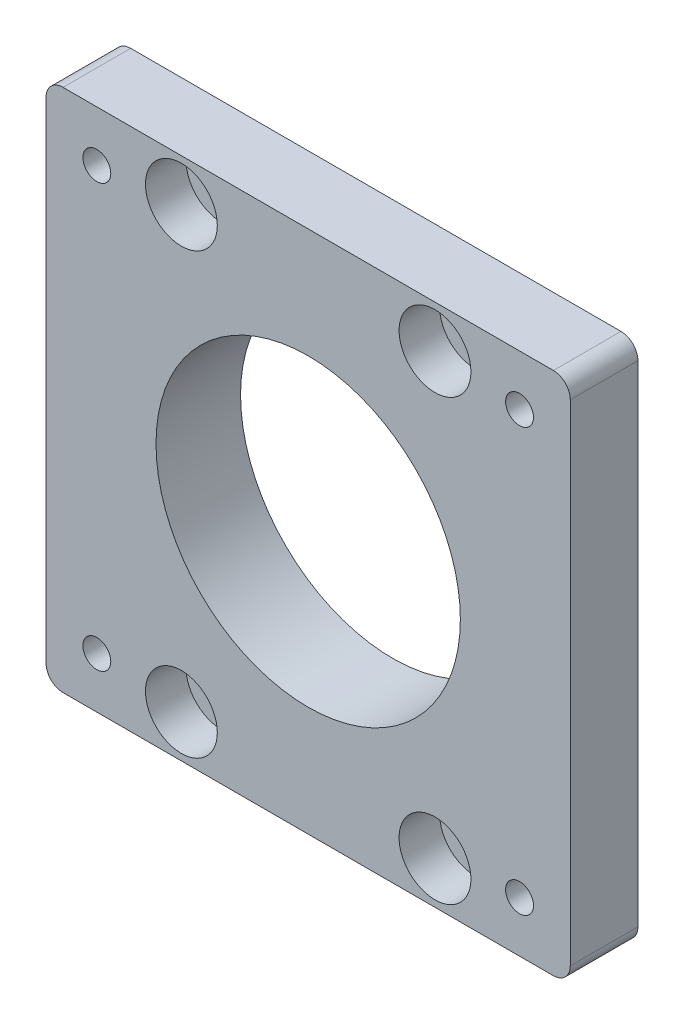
ISO-10303-21;
HEADER;
FILE_DESCRIPTION(('STEP AP214'),'2;1');
FILE_NAME('part.step','',(''),(''),'','','');
FILE_SCHEMA(('AUTOMOTIVE_DESIGN { 1 0 10303 214 1 1 1 1 }'));
ENDSEC;
DATA;
#1=APPLICATION_CONTEXT('core data for automotive mechanical design processes');
#2=APPLICATION_PROTOCOL_DEFINITION('international standard','automotive_design',2000,#1);
#3=PRODUCT_CONTEXT('',#1,'mechanical');
#4=PRODUCT('Part','Part','',(#3));
#5=PRODUCT_RELATED_PRODUCT_CATEGORY('part','',(#4));
#6=PRODUCT_DEFINITION_FORMATION('','',#4);
#7=PRODUCT_DEFINITION_CONTEXT('part definition',#1,'design');
#8=PRODUCT_DEFINITION('design','',#6,#7);
#9=PRODUCT_DEFINITION_SHAPE('','',#8);
#10=(LENGTH_UNIT() NAMED_UNIT(*) SI_UNIT(.MILLI.,.METRE.));
#11=(NAMED_UNIT(*) PLANE_ANGLE_UNIT() SI_UNIT($,.RADIAN.));
#12=(NAMED_UNIT(*) SI_UNIT($,.STERADIAN.) SOLID_ANGLE_UNIT());
#13=UNCERTAINTY_MEASURE_WITH_UNIT(LENGTH_MEASURE(1.E-05),#10,'distance_accuracy_value','');
#14=(GEOMETRIC_REPRESENTATION_CONTEXT(3) GLOBAL_UNCERTAINTY_ASSIGNED_CONTEXT((#13)) GLOBAL_UNIT_ASSIGNED_CONTEXT((#10,
#11,#12)) REPRESENTATION_CONTEXT('',''));
#15=CARTESIAN_POINT('',(0.,0.,0.));
#16=DIRECTION('',(0.,0.,1.));
#17=DIRECTION('',(1.,0.,0.));
#18=AXIS2_PLACEMENT_3D('',#15,#16,#17);
#19=CARTESIAN_POINT('',(0.,0.,0.));
#20=DIRECTION('',(0.,0.,-1.));
#21=DIRECTION('',(-1.,0.,0.));
#22=AXIS2_PLACEMENT_3D('',#19,#20,#21);
#23=PLANE('',#22);
#24=CARTESIAN_POINT('',(-25.,25.,0.));
#25=DIRECTION('',(0.,0.,-1.));
#26=DIRECTION('',(-1.,0.,0.));
#27=AXIS2_PLACEMENT_3D('',#24,#25,#26);
#28=CIRCLE('',#27,1.64999999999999);
#29=CARTESIAN_POINT('',(-26.65,25.,0.));
#30=VERTEX_POINT('',#29);
#31=EDGE_CURVE('E310',#30,#30,#28,.T.);
#32=ORIENTED_EDGE('',*,*,#31,.F.);
#33=EDGE_LOOP('',(#32));
#34=FACE_BOUND('',#33,.T.);
#35=CARTESIAN_POINT('',(-25.,-25.,0.));
#36=DIRECTION('',(0.,0.,-1.));
#37=DIRECTION('',(-1.,0.,0.));
#38=AXIS2_PLACEMENT_3D('',#35,#36,#37);
#39=CIRCLE('',#38,1.64999999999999);
#40=CARTESIAN_POINT('',(-26.65,-25.,0.));
#41=VERTEX_POINT('',#40);
#42=EDGE_CURVE('E302',#41,#41,#39,.T.);
#43=ORIENTED_EDGE('',*,*,#42,.F.);
#44=EDGE_LOOP('',(#43));
#45=FACE_BOUND('',#44,.T.);
#46=CARTESIAN_POINT('',(25.,-25.,0.));
#47=DIRECTION('',(0.,0.,-1.));
#48=DIRECTION('',(-1.,0.,0.));
#49=AXIS2_PLACEMENT_3D('',#46,#47,#48);
#50=CIRCLE('',#49,1.64999999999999);
#51=CARTESIAN_POINT('',(23.35,-25.,0.));
#52=VERTEX_POINT('',#51);
#53=EDGE_CURVE('E294',#52,#52,#50,.T.);
#54=ORIENTED_EDGE('',*,*,#53,.F.);
#55=EDGE_LOOP('',(#54));
#56=FACE_BOUND('',#55,.T.);
#57=CARTESIAN_POINT('',(25.,25.,0.));
#58=DIRECTION('',(0.,0.,-1.));
#59=DIRECTION('',(-1.,0.,0.));
#60=AXIS2_PLACEMENT_3D('',#57,#58,#59);
#61=CIRCLE('',#60,1.64999999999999);
#62=CARTESIAN_POINT('',(23.35,25.,0.));
#63=VERTEX_POINT('',#62);
#64=EDGE_CURVE('E44',#63,#63,#61,.T.);
#65=ORIENTED_EDGE('',*,*,#64,.F.);
#66=EDGE_LOOP('',(#65));
#67=FACE_BOUND('',#66,.T.);
#68=DIRECTION('',(0.,-1.,0.));
#69=VECTOR('',#68,1.);
#70=CARTESIAN_POINT('',(-31.,-31.,0.));
#71=LINE('',#70,#69);
#72=CARTESIAN_POINT('',(-31.,29.,0.));
#73=VERTEX_POINT('',#72);
#74=CARTESIAN_POINT('',(-31.,-29.,0.));
#75=VERTEX_POINT('',#74);
#76=EDGE_CURVE('E127',#73,#75,#71,.T.);
#77=ORIENTED_EDGE('',*,*,#76,.F.);
#78=CARTESIAN_POINT('',(-29.,29.,0.));
#79=DIRECTION('',(0.,0.,-1.));
#80=DIRECTION('',(-1.,0.,0.));
#81=AXIS2_PLACEMENT_3D('',#78,#79,#80);
#82=CIRCLE('',#81,2.);
#83=CARTESIAN_POINT('',(-29.,31.,0.));
#84=VERTEX_POINT('',#83);
#85=EDGE_CURVE('E109',#73,#84,#82,.T.);
#86=ORIENTED_EDGE('',*,*,#85,.T.);
#87=DIRECTION('',(-1.,0.,0.));
#88=VECTOR('',#87,1.);
#89=CARTESIAN_POINT('',(-31.,31.,0.));
#90=LINE('',#89,#88);
#91=CARTESIAN_POINT('',(29.,31.,0.));
#92=VERTEX_POINT('',#91);
#93=EDGE_CURVE('E138',#92,#84,#90,.T.);
#94=ORIENTED_EDGE('',*,*,#93,.F.);
#95=CARTESIAN_POINT('',(29.,29.,0.));
#96=DIRECTION('',(0.,0.,-1.));
#97=DIRECTION('',(-1.,0.,0.));
#98=AXIS2_PLACEMENT_3D('',#95,#96,#97);
#99=CIRCLE('',#98,2.);
#100=CARTESIAN_POINT('',(31.,29.,0.));
#101=VERTEX_POINT('',#100);
#102=EDGE_CURVE('E131',#92,#101,#99,.T.);
#103=ORIENTED_EDGE('',*,*,#102,.T.);
#104=DIRECTION('',(0.,1.,0.));
#105=VECTOR('',#104,1.);
#106=CARTESIAN_POINT('',(31.,-31.,0.));
#107=LINE('',#106,#105);
#108=CARTESIAN_POINT('',(31.,-29.,0.));
#109=VERTEX_POINT('',#108);
#110=EDGE_CURVE('E146',#109,#101,#107,.T.);
#111=ORIENTED_EDGE('',*,*,#110,.F.);
#112=CARTESIAN_POINT('',(29.,-29.,0.));
#113=DIRECTION('',(0.,0.,-1.));
#114=DIRECTION('',(-1.,0.,0.));
#115=AXIS2_PLACEMENT_3D('',#112,#113,#114);
#116=CIRCLE('',#115,2.);
#117=CARTESIAN_POINT('',(29.,-31.,0.));
#118=VERTEX_POINT('',#117);
#119=EDGE_CURVE('E179',#109,#118,#116,.T.);
#120=ORIENTED_EDGE('',*,*,#119,.T.);
#121=DIRECTION('',(1.,0.,0.));
#122=VECTOR('',#121,1.);
#123=CARTESIAN_POINT('',(-31.,-31.,0.));
#124=LINE('',#123,#122);
#125=CARTESIAN_POINT('',(-29.,-31.,0.));
#126=VERTEX_POINT('',#125);
#127=EDGE_CURVE('E137',#126,#118,#124,.T.);
#128=ORIENTED_EDGE('',*,*,#127,.F.);
#129=CARTESIAN_POINT('',(-29.,-29.,0.));
#130=DIRECTION('',(0.,0.,-1.));
#131=DIRECTION('',(-1.,0.,0.));
#132=AXIS2_PLACEMENT_3D('',#129,#130,#131);
#133=CIRCLE('',#132,2.);
#134=EDGE_CURVE('E121',#126,#75,#133,.T.);
#135=ORIENTED_EDGE('',*,*,#134,.T.);
#136=EDGE_LOOP('',(#77,#86,#94,#103,#111,#120,#128,#135));
#137=FACE_BOUND('',#136,.T.);
#138=CARTESIAN_POINT('',(-15.,25.9807621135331,0.));
#139=DIRECTION('',(0.,0.,1.));
#140=DIRECTION('',(1.,0.,0.));
#141=AXIS2_PLACEMENT_3D('',#138,#139,#140);
#142=CIRCLE('',#141,2.25);
#143=CARTESIAN_POINT('',(-12.75,25.9807621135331,0.));
#144=VERTEX_POINT('',#143);
#145=EDGE_CURVE('E233',#144,#144,#142,.T.);
#146=ORIENTED_EDGE('',*,*,#145,.T.);
#147=EDGE_LOOP('',(#146));
#148=FACE_BOUND('',#147,.T.);
#149=CARTESIAN_POINT('',(15.,25.9807621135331,0.));
#150=DIRECTION('',(0.,0.,1.));
#151=DIRECTION('',(1.,0.,0.));
#152=AXIS2_PLACEMENT_3D('',#149,#150,#151);
#153=CIRCLE('',#152,2.25);
#154=CARTESIAN_POINT('',(17.25,25.9807621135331,0.));
#155=VERTEX_POINT('',#154);
#156=EDGE_CURVE('E243',#155,#155,#153,.T.);
#157=ORIENTED_EDGE('',*,*,#156,.T.);
#158=EDGE_LOOP('',(#157));
#159=FACE_BOUND('',#158,.T.);
#160=CARTESIAN_POINT('',(15.,-25.9807621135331,0.));
#161=DIRECTION('',(0.,0.,1.));
#162=DIRECTION('',(1.,0.,0.));
#163=AXIS2_PLACEMENT_3D('',#160,#161,#162);
#164=CIRCLE('',#163,2.25);
#165=CARTESIAN_POINT('',(17.25,-25.9807621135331,0.));
#166=VERTEX_POINT('',#165);
#167=EDGE_CURVE('E247',#166,#166,#164,.T.);
#168=ORIENTED_EDGE('',*,*,#167,.T.);
#169=EDGE_LOOP('',(#168));
#170=FACE_BOUND('',#169,.T.);
#171=CARTESIAN_POINT('',(-15.,-25.9807621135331,0.));
#172=DIRECTION('',(0.,0.,1.));
#173=DIRECTION('',(1.,0.,0.));
#174=AXIS2_PLACEMENT_3D('',#171,#172,#173);
#175=CIRCLE('',#174,2.25);
#176=CARTESIAN_POINT('',(-12.75,-25.9807621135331,0.));
#177=VERTEX_POINT('',#176);
#178=EDGE_CURVE('E154',#177,#177,#175,.T.);
#179=ORIENTED_EDGE('',*,*,#178,.T.);
#180=EDGE_LOOP('',(#179));
#181=FACE_BOUND('',#180,.T.);
#182=CARTESIAN_POINT('',(0.,0.,0.));
#183=DIRECTION('',(0.,0.,-1.));
#184=DIRECTION('',(-1.,0.,0.));
#185=AXIS2_PLACEMENT_3D('',#182,#183,#184);
#186=CIRCLE('',#185,25.);
#187=CARTESIAN_POINT('',(-25.,0.,0.));
#188=VERTEX_POINT('',#187);
#189=EDGE_CURVE('E280',#188,#188,#186,.T.);
#190=ORIENTED_EDGE('',*,*,#189,.F.);
#191=EDGE_LOOP('',(#190));
#192=FACE_BOUND('',#191,.T.);
#193=ADVANCED_FACE('F40',(#34,#45,#56,#67,#137,#148,#159,#170,#181,#192),#23,.T.);
#194=CARTESIAN_POINT('',(-15.,-25.9807621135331,0.));
#195=DIRECTION('',(0.,0.,1.));
#196=DIRECTION('',(1.,0.,0.));
#197=AXIS2_PLACEMENT_3D('',#194,#195,#196);
#198=CYLINDRICAL_SURFACE('',#197,2.25);
#199=ORIENTED_EDGE('',*,*,#178,.F.);
#200=EDGE_LOOP('',(#199));
#201=FACE_BOUND('',#200,.T.);
#202=CARTESIAN_POINT('',(-15.,-25.9807621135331,3.2));
#203=DIRECTION('',(0.,0.,1.));
#204=DIRECTION('',(1.,0.,0.));
#205=AXIS2_PLACEMENT_3D('',#202,#203,#204);
#206=CIRCLE('',#205,2.25);
#207=CARTESIAN_POINT('',(-12.75,-25.9807621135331,3.2));
#208=VERTEX_POINT('',#207);
#209=EDGE_CURVE('E168',#208,#208,#206,.F.);
#210=ORIENTED_EDGE('',*,*,#209,.F.);
#211=EDGE_LOOP('',(#210));
#212=FACE_BOUND('',#211,.T.);
#213=ADVANCED_FACE('F358',(#201,#212),#198,.F.);
#214=CARTESIAN_POINT('',(15.,-25.9807621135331,0.));
#215=DIRECTION('',(0.,0.,1.));
#216=DIRECTION('',(1.,0.,0.));
#217=AXIS2_PLACEMENT_3D('',#214,#215,#216);
#218=CYLINDRICAL_SURFACE('',#217,2.25);
#219=ORIENTED_EDGE('',*,*,#167,.F.);
#220=EDGE_LOOP('',(#219));
#221=FACE_BOUND('',#220,.T.);
#222=CARTESIAN_POINT('',(15.,-25.9807621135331,3.2));
#223=DIRECTION('',(0.,0.,1.));
#224=DIRECTION('',(1.,0.,0.));
#225=AXIS2_PLACEMENT_3D('',#222,#223,#224);
#226=CIRCLE('',#225,2.25);
#227=CARTESIAN_POINT('',(17.25,-25.9807621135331,3.2));
#228=VERTEX_POINT('',#227);
#229=EDGE_CURVE('E162',#228,#228,#226,.F.);
#230=ORIENTED_EDGE('',*,*,#229,.F.);
#231=EDGE_LOOP('',(#230));
#232=FACE_BOUND('',#231,.T.);
#233=ADVANCED_FACE('F364',(#221,#232),#218,.F.);
#234=CARTESIAN_POINT('',(15.,25.9807621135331,0.));
#235=DIRECTION('',(0.,0.,1.));
#236=DIRECTION('',(1.,0.,0.));
#237=AXIS2_PLACEMENT_3D('',#234,#235,#236);
#238=CYLINDRICAL_SURFACE('',#237,2.25);
#239=ORIENTED_EDGE('',*,*,#156,.F.);
#240=EDGE_LOOP('',(#239));
#241=FACE_BOUND('',#240,.T.);
#242=CARTESIAN_POINT('',(15.,25.9807621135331,3.2));
#243=DIRECTION('',(0.,0.,1.));
#244=DIRECTION('',(1.,0.,0.));
#245=AXIS2_PLACEMENT_3D('',#242,#243,#244);
#246=CIRCLE('',#245,2.25);
#247=CARTESIAN_POINT('',(17.25,25.9807621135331,3.2));
#248=VERTEX_POINT('',#247);
#249=EDGE_CURVE('E156',#248,#248,#246,.F.);
#250=ORIENTED_EDGE('',*,*,#249,.F.);
#251=EDGE_LOOP('',(#250));
#252=FACE_BOUND('',#251,.T.);
#253=ADVANCED_FACE('F432',(#241,#252),#238,.F.);
#254=CARTESIAN_POINT('',(-15.,25.9807621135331,0.));
#255=DIRECTION('',(0.,0.,1.));
#256=DIRECTION('',(1.,0.,0.));
#257=AXIS2_PLACEMENT_3D('',#254,#255,#256);
#258=CYLINDRICAL_SURFACE('',#257,2.25);
#259=ORIENTED_EDGE('',*,*,#145,.F.);
#260=EDGE_LOOP('',(#259));
#261=FACE_BOUND('',#260,.T.);
#262=CARTESIAN_POINT('',(-15.,25.9807621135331,3.2));
#263=DIRECTION('',(0.,0.,1.));
#264=DIRECTION('',(1.,0.,0.));
#265=AXIS2_PLACEMENT_3D('',#262,#263,#264);
#266=CIRCLE('',#265,2.25);
#267=CARTESIAN_POINT('',(-12.75,25.9807621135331,3.2));
#268=VERTEX_POINT('',#267);
#269=EDGE_CURVE('E150',#268,#268,#266,.F.);
#270=ORIENTED_EDGE('',*,*,#269,.F.);
#271=EDGE_LOOP('',(#270));
#272=FACE_BOUND('',#271,.T.);
#273=ADVANCED_FACE('F323',(#261,#272),#258,.F.);
#274=CARTESIAN_POINT('',(0.,0.,8.));
#275=DIRECTION('',(0.,0.,-1.));
#276=DIRECTION('',(-1.,0.,0.));
#277=AXIS2_PLACEMENT_3D('',#274,#275,#276);
#278=PLANE('',#277);
#279=CARTESIAN_POINT('',(-25.,25.,8.));
#280=DIRECTION('',(0.,0.,1.));
#281=DIRECTION('',(1.,0.,0.));
#282=AXIS2_PLACEMENT_3D('',#279,#280,#281);
#283=CIRCLE('',#282,1.64999999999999);
#284=CARTESIAN_POINT('',(-23.35,25.,8.));
#285=VERTEX_POINT('',#284);
#286=EDGE_CURVE('E314',#285,#285,#283,.T.);
#287=ORIENTED_EDGE('',*,*,#286,.F.);
#288=EDGE_LOOP('',(#287));
#289=FACE_BOUND('',#288,.T.);
#290=CARTESIAN_POINT('',(-25.,-25.,8.));
#291=DIRECTION('',(0.,0.,1.));
#292=DIRECTION('',(1.,0.,0.));
#293=AXIS2_PLACEMENT_3D('',#290,#291,#292);
#294=CIRCLE('',#293,1.64999999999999);
#295=CARTESIAN_POINT('',(-23.35,-25.,8.));
#296=VERTEX_POINT('',#295);
#297=EDGE_CURVE('E306',#296,#296,#294,.T.);
#298=ORIENTED_EDGE('',*,*,#297,.F.);
#299=EDGE_LOOP('',(#298));
#300=FACE_BOUND('',#299,.T.);
#301=CARTESIAN_POINT('',(25.,-25.,8.));
#302=DIRECTION('',(0.,0.,1.));
#303=DIRECTION('',(1.,0.,0.));
#304=AXIS2_PLACEMENT_3D('',#301,#302,#303);
#305=CIRCLE('',#304,1.64999999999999);
#306=CARTESIAN_POINT('',(26.65,-25.,8.));
#307=VERTEX_POINT('',#306);
#308=EDGE_CURVE('E298',#307,#307,#305,.T.);
#309=ORIENTED_EDGE('',*,*,#308,.F.);
#310=EDGE_LOOP('',(#309));
#311=FACE_BOUND('',#310,.T.);
#312=CARTESIAN_POINT('',(25.,25.,8.));
#313=DIRECTION('',(0.,0.,1.));
#314=DIRECTION('',(1.,0.,0.));
#315=AXIS2_PLACEMENT_3D('',#312,#313,#314);
#316=CIRCLE('',#315,1.64999999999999);
#317=CARTESIAN_POINT('',(26.65,25.,8.));
#318=VERTEX_POINT('',#317);
#319=EDGE_CURVE('E290',#318,#318,#316,.T.);
#320=ORIENTED_EDGE('',*,*,#319,.F.);
#321=EDGE_LOOP('',(#320));
#322=FACE_BOUND('',#321,.T.);
#323=CARTESIAN_POINT('',(-15.,-25.9807621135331,8.));
#324=DIRECTION('',(0.,0.,1.));
#325=DIRECTION('',(1.,0.,0.));
#326=AXIS2_PLACEMENT_3D('',#323,#324,#325);
#327=CIRCLE('',#326,4.25);
#328=CARTESIAN_POINT('',(-10.75,-25.9807621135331,8.));
#329=VERTEX_POINT('',#328);
#330=EDGE_CURVE('E272',#329,#329,#327,.T.);
#331=ORIENTED_EDGE('',*,*,#330,.F.);
#332=EDGE_LOOP('',(#331));
#333=FACE_BOUND('',#332,.T.);
#334=CARTESIAN_POINT('',(15.,-25.9807621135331,8.));
#335=DIRECTION('',(0.,0.,1.));
#336=DIRECTION('',(1.,0.,0.));
#337=AXIS2_PLACEMENT_3D('',#334,#335,#336);
#338=CIRCLE('',#337,4.25);
#339=CARTESIAN_POINT('',(19.25,-25.9807621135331,8.));
#340=VERTEX_POINT('',#339);
#341=EDGE_CURVE('E172',#340,#340,#338,.T.);
#342=ORIENTED_EDGE('',*,*,#341,.F.);
#343=EDGE_LOOP('',(#342));
#344=FACE_BOUND('',#343,.T.);
#345=CARTESIAN_POINT('',(15.,25.9807621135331,8.));
#346=DIRECTION('',(0.,0.,1.));
#347=DIRECTION('',(1.,0.,0.));
#348=AXIS2_PLACEMENT_3D('',#345,#346,#347);
#349=CIRCLE('',#348,4.25);
#350=CARTESIAN_POINT('',(19.25,25.9807621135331,8.));
#351=VERTEX_POINT('',#350);
#352=EDGE_CURVE('E166',#351,#351,#349,.T.);
#353=ORIENTED_EDGE('',*,*,#352,.F.);
#354=EDGE_LOOP('',(#353));
#355=FACE_BOUND('',#354,.T.);
#356=CARTESIAN_POINT('',(-15.,25.9807621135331,8.));
#357=DIRECTION('',(0.,0.,1.));
#358=DIRECTION('',(1.,0.,0.));
#359=AXIS2_PLACEMENT_3D('',#356,#357,#358);
#360=CIRCLE('',#359,4.25);
#361=CARTESIAN_POINT('',(-10.75,25.9807621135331,8.));
#362=VERTEX_POINT('',#361);
#363=EDGE_CURVE('E160',#362,#362,#360,.T.);
#364=ORIENTED_EDGE('',*,*,#363,.F.);
#365=EDGE_LOOP('',(#364));
#366=FACE_BOUND('',#365,.T.);
#367=DIRECTION('',(-1.,0.,0.));
#368=VECTOR('',#367,1.);
#369=CARTESIAN_POINT('',(-31.,31.,8.));
#370=LINE('',#369,#368);
#371=CARTESIAN_POINT('',(29.,31.,8.));
#372=VERTEX_POINT('',#371);
#373=CARTESIAN_POINT('',(-29.,31.,8.));
#374=VERTEX_POINT('',#373);
#375=EDGE_CURVE('E224',#372,#374,#370,.T.);
#376=ORIENTED_EDGE('',*,*,#375,.T.);
#377=CARTESIAN_POINT('',(-29.,29.,8.));
#378=DIRECTION('',(0.,0.,-1.));
#379=DIRECTION('',(-1.,0.,0.));
#380=AXIS2_PLACEMENT_3D('',#377,#378,#379);
#381=CIRCLE('',#380,2.);
#382=CARTESIAN_POINT('',(-31.,29.,8.));
#383=VERTEX_POINT('',#382);
#384=EDGE_CURVE('E197',#374,#383,#381,.F.);
#385=ORIENTED_EDGE('',*,*,#384,.T.);
#386=DIRECTION('',(0.,-1.,0.));
#387=VECTOR('',#386,1.);
#388=CARTESIAN_POINT('',(-31.,-31.,8.));
#389=LINE('',#388,#387);
#390=CARTESIAN_POINT('',(-31.,-29.,8.));
#391=VERTEX_POINT('',#390);
#392=EDGE_CURVE('E129',#383,#391,#389,.T.);
#393=ORIENTED_EDGE('',*,*,#392,.T.);
#394=CARTESIAN_POINT('',(-29.,-29.,8.));
#395=DIRECTION('',(0.,0.,-1.));
#396=DIRECTION('',(-1.,0.,0.));
#397=AXIS2_PLACEMENT_3D('',#394,#395,#396);
#398=CIRCLE('',#397,2.);
#399=CARTESIAN_POINT('',(-29.,-31.,8.));
#400=VERTEX_POINT('',#399);
#401=EDGE_CURVE('E64',#391,#400,#398,.F.);
#402=ORIENTED_EDGE('',*,*,#401,.T.);
#403=DIRECTION('',(1.,0.,0.));
#404=VECTOR('',#403,1.);
#405=CARTESIAN_POINT('',(-31.,-31.,8.));
#406=LINE('',#405,#404);
#407=CARTESIAN_POINT('',(29.,-31.,8.));
#408=VERTEX_POINT('',#407);
#409=EDGE_CURVE('E175',#400,#408,#406,.T.);
#410=ORIENTED_EDGE('',*,*,#409,.T.);
#411=CARTESIAN_POINT('',(29.,-29.,8.));
#412=DIRECTION('',(0.,0.,-1.));
#413=DIRECTION('',(-1.,0.,0.));
#414=AXIS2_PLACEMENT_3D('',#411,#412,#413);
#415=CIRCLE('',#414,2.);
#416=CARTESIAN_POINT('',(31.,-29.,8.));
#417=VERTEX_POINT('',#416);
#418=EDGE_CURVE('E192',#408,#417,#415,.F.);
#419=ORIENTED_EDGE('',*,*,#418,.T.);
#420=DIRECTION('',(0.,1.,0.));
#421=VECTOR('',#420,1.);
#422=CARTESIAN_POINT('',(31.,-31.,8.));
#423=LINE('',#422,#421);
#424=CARTESIAN_POINT('',(31.,29.,8.));
#425=VERTEX_POINT('',#424);
#426=EDGE_CURVE('E143',#417,#425,#423,.T.);
#427=ORIENTED_EDGE('',*,*,#426,.T.);
#428=CARTESIAN_POINT('',(29.,29.,8.));
#429=DIRECTION('',(0.,0.,-1.));
#430=DIRECTION('',(-1.,0.,0.));
#431=AXIS2_PLACEMENT_3D('',#428,#429,#430);
#432=CIRCLE('',#431,2.);
#433=EDGE_CURVE('E189',#425,#372,#432,.F.);
#434=ORIENTED_EDGE('',*,*,#433,.T.);
#435=EDGE_LOOP('',(#376,#385,#393,#402,#410,#419,#427,#434));
#436=FACE_BOUND('',#435,.T.);
#437=CARTESIAN_POINT('',(0.,0.,8.));
#438=DIRECTION('',(0.,0.,1.));
#439=DIRECTION('',(1.,0.,0.));
#440=AXIS2_PLACEMENT_3D('',#437,#438,#439);
#441=CIRCLE('',#440,18.);
#442=CARTESIAN_POINT('',(18.,0.,8.));
#443=VERTEX_POINT('',#442);
#444=EDGE_CURVE('E230',#443,#443,#441,.T.);
#445=ORIENTED_EDGE('',*,*,#444,.F.);
#446=EDGE_LOOP('',(#445));
#447=FACE_BOUND('',#446,.T.);
#448=ADVANCED_FACE('F219',(#289,#300,#311,#322,#333,#344,#355,#366,#436,#447),#278,.F.);
#449=CARTESIAN_POINT('',(31.,-31.,8.));
#450=DIRECTION('',(-1.,0.,0.));
#451=DIRECTION('',(0.,0.,1.));
#452=AXIS2_PLACEMENT_3D('',#449,#450,#451);
#453=PLANE('',#452);
#454=ORIENTED_EDGE('',*,*,#426,.F.);
#455=DIRECTION('',(0.,0.,-1.));
#456=VECTOR('',#455,1.);
#457=CARTESIAN_POINT('',(31.,-29.,8.));
#458=LINE('',#457,#456);
#459=EDGE_CURVE('E11',#417,#109,#458,.T.);
#460=ORIENTED_EDGE('',*,*,#459,.T.);
#461=ORIENTED_EDGE('',*,*,#110,.T.);
#462=DIRECTION('',(0.,0.,-1.));
#463=VECTOR('',#462,1.);
#464=CARTESIAN_POINT('',(31.,29.,8.));
#465=LINE('',#464,#463);
#466=EDGE_CURVE('E50',#101,#425,#465,.F.);
#467=ORIENTED_EDGE('',*,*,#466,.T.);
#468=EDGE_LOOP('',(#454,#460,#461,#467));
#469=FACE_BOUND('',#468,.T.);
#470=ADVANCED_FACE('F213',(#469),#453,.F.);
#471=CARTESIAN_POINT('',(-31.,31.,8.));
#472=DIRECTION('',(0.,-1.,0.));
#473=DIRECTION('',(0.,0.,-1.));
#474=AXIS2_PLACEMENT_3D('',#471,#472,#473);
#475=PLANE('',#474);
#476=ORIENTED_EDGE('',*,*,#93,.T.);
#477=DIRECTION('',(0.,0.,-1.));
#478=VECTOR('',#477,1.);
#479=CARTESIAN_POINT('',(-29.,31.,8.));
#480=LINE('',#479,#478);
#481=EDGE_CURVE('E114',#84,#374,#480,.F.);
#482=ORIENTED_EDGE('',*,*,#481,.T.);
#483=ORIENTED_EDGE('',*,*,#375,.F.);
#484=DIRECTION('',(0.,0.,-1.));
#485=VECTOR('',#484,1.);
#486=CARTESIAN_POINT('',(29.,31.,8.));
#487=LINE('',#486,#485);
#488=EDGE_CURVE('E120',#372,#92,#487,.T.);
#489=ORIENTED_EDGE('',*,*,#488,.T.);
#490=EDGE_LOOP('',(#476,#482,#483,#489));
#491=FACE_BOUND('',#490,.T.);
#492=ADVANCED_FACE('F228',(#491),#475,.F.);
#493=CARTESIAN_POINT('',(-31.,-31.,8.));
#494=DIRECTION('',(1.,0.,0.));
#495=DIRECTION('',(0.,0.,-1.));
#496=AXIS2_PLACEMENT_3D('',#493,#494,#495);
#497=PLANE('',#496);
#498=ORIENTED_EDGE('',*,*,#392,.F.);
#499=DIRECTION('',(0.,0.,-1.));
#500=VECTOR('',#499,1.);
#501=CARTESIAN_POINT('',(-31.,29.,8.));
#502=LINE('',#501,#500);
#503=EDGE_CURVE('E113',#383,#73,#502,.T.);
#504=ORIENTED_EDGE('',*,*,#503,.T.);
#505=ORIENTED_EDGE('',*,*,#76,.T.);
#506=DIRECTION('',(0.,0.,-1.));
#507=VECTOR('',#506,1.);
#508=CARTESIAN_POINT('',(-31.,-29.,8.));
#509=LINE('',#508,#507);
#510=EDGE_CURVE('E132',#75,#391,#509,.F.);
#511=ORIENTED_EDGE('',*,*,#510,.T.);
#512=EDGE_LOOP('',(#498,#504,#505,#511));
#513=FACE_BOUND('',#512,.T.);
#514=ADVANCED_FACE('F126',(#513),#497,.F.);
#515=CARTESIAN_POINT('',(-31.,-31.,8.));
#516=DIRECTION('',(0.,1.,0.));
#517=DIRECTION('',(0.,0.,1.));
#518=AXIS2_PLACEMENT_3D('',#515,#516,#517);
#519=PLANE('',#518);
#520=ORIENTED_EDGE('',*,*,#409,.F.);
#521=DIRECTION('',(0.,0.,-1.));
#522=VECTOR('',#521,1.);
#523=CARTESIAN_POINT('',(-29.,-31.,8.));
#524=LINE('',#523,#522);
#525=EDGE_CURVE('E201',#400,#126,#524,.T.);
#526=ORIENTED_EDGE('',*,*,#525,.T.);
#527=ORIENTED_EDGE('',*,*,#127,.T.);
#528=DIRECTION('',(0.,0.,-1.));
#529=VECTOR('',#528,1.);
#530=CARTESIAN_POINT('',(29.,-31.,8.));
#531=LINE('',#530,#529);
#532=EDGE_CURVE('E57',#118,#408,#531,.F.);
#533=ORIENTED_EDGE('',*,*,#532,.T.);
#534=EDGE_LOOP('',(#520,#526,#527,#533));
#535=FACE_BOUND('',#534,.T.);
#536=ADVANCED_FACE('F370',(#535),#519,.F.);
#537=CARTESIAN_POINT('',(0.,0.,8.));
#538=DIRECTION('',(0.,0.,-1.));
#539=DIRECTION('',(-1.,0.,0.));
#540=AXIS2_PLACEMENT_3D('',#537,#538,#539);
#541=CYLINDRICAL_SURFACE('',#540,18.);
#542=ORIENTED_EDGE('',*,*,#444,.T.);
#543=EDGE_LOOP('',(#542));
#544=FACE_BOUND('',#543,.T.);
#545=CARTESIAN_POINT('',(0.,0.,-2.));
#546=DIRECTION('',(0.,0.,-1.));
#547=DIRECTION('',(-1.,0.,0.));
#548=AXIS2_PLACEMENT_3D('',#545,#546,#547);
#549=CIRCLE('',#548,18.);
#550=CARTESIAN_POINT('',(-18.,0.,-2.));
#551=VERTEX_POINT('',#550);
#552=EDGE_CURVE('E284',#551,#551,#549,.T.);
#553=ORIENTED_EDGE('',*,*,#552,.T.);
#554=EDGE_LOOP('',(#553));
#555=FACE_BOUND('',#554,.T.);
#556=ADVANCED_FACE('F352',(#544,#555),#541,.F.);
#557=CARTESIAN_POINT('',(-15.,25.9807621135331,3.2));
#558=DIRECTION('',(0.,0.,1.));
#559=DIRECTION('',(1.,0.,0.));
#560=AXIS2_PLACEMENT_3D('',#557,#558,#559);
#561=PLANE('',#560);
#562=CARTESIAN_POINT('',(-15.,25.9807621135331,3.2));
#563=DIRECTION('',(0.,0.,1.));
#564=DIRECTION('',(1.,0.,0.));
#565=AXIS2_PLACEMENT_3D('',#562,#563,#564);
#566=CIRCLE('',#565,4.25);
#567=CARTESIAN_POINT('',(-10.75,25.9807621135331,3.2));
#568=VERTEX_POINT('',#567);
#569=EDGE_CURVE('E155',#568,#568,#566,.T.);
#570=ORIENTED_EDGE('',*,*,#569,.T.);
#571=EDGE_LOOP('',(#570));
#572=FACE_BOUND('',#571,.T.);
#573=ORIENTED_EDGE('',*,*,#269,.T.);
#574=EDGE_LOOP('',(#573));
#575=FACE_BOUND('',#574,.T.);
#576=ADVANCED_FACE('F342',(#572,#575),#561,.T.);
#577=CARTESIAN_POINT('',(-15.,25.9807621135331,3.2));
#578=DIRECTION('',(0.,0.,1.));
#579=DIRECTION('',(1.,0.,0.));
#580=AXIS2_PLACEMENT_3D('',#577,#578,#579);
#581=CYLINDRICAL_SURFACE('',#580,4.25);
#582=ORIENTED_EDGE('',*,*,#569,.F.);
#583=EDGE_LOOP('',(#582));
#584=FACE_BOUND('',#583,.T.);
#585=ORIENTED_EDGE('',*,*,#363,.T.);
#586=EDGE_LOOP('',(#585));
#587=FACE_BOUND('',#586,.T.);
#588=ADVANCED_FACE('F339',(#584,#587),#581,.F.);
#589=CARTESIAN_POINT('',(15.,25.9807621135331,3.2));
#590=DIRECTION('',(0.,0.,1.));
#591=DIRECTION('',(1.,0.,0.));
#592=AXIS2_PLACEMENT_3D('',#589,#590,#591);
#593=PLANE('',#592);
#594=CARTESIAN_POINT('',(15.,25.9807621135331,3.2));
#595=DIRECTION('',(0.,0.,1.));
#596=DIRECTION('',(1.,0.,0.));
#597=AXIS2_PLACEMENT_3D('',#594,#595,#596);
#598=CIRCLE('',#597,4.25);
#599=CARTESIAN_POINT('',(19.25,25.9807621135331,3.2));
#600=VERTEX_POINT('',#599);
#601=EDGE_CURVE('E161',#600,#600,#598,.T.);
#602=ORIENTED_EDGE('',*,*,#601,.T.);
#603=EDGE_LOOP('',(#602));
#604=FACE_BOUND('',#603,.T.);
#605=ORIENTED_EDGE('',*,*,#249,.T.);
#606=EDGE_LOOP('',(#605));
#607=FACE_BOUND('',#606,.T.);
#608=ADVANCED_FACE('F341',(#604,#607),#593,.T.);
#609=CARTESIAN_POINT('',(15.,25.9807621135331,3.2));
#610=DIRECTION('',(0.,0.,1.));
#611=DIRECTION('',(1.,0.,0.));
#612=AXIS2_PLACEMENT_3D('',#609,#610,#611);
#613=CYLINDRICAL_SURFACE('',#612,4.25);
#614=ORIENTED_EDGE('',*,*,#601,.F.);
#615=EDGE_LOOP('',(#614));
#616=FACE_BOUND('',#615,.T.);
#617=ORIENTED_EDGE('',*,*,#352,.T.);
#618=EDGE_LOOP('',(#617));
#619=FACE_BOUND('',#618,.T.);
#620=ADVANCED_FACE('F349',(#616,#619),#613,.F.);
#621=CARTESIAN_POINT('',(15.,-25.9807621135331,3.2));
#622=DIRECTION('',(0.,0.,1.));
#623=DIRECTION('',(1.,0.,0.));
#624=AXIS2_PLACEMENT_3D('',#621,#622,#623);
#625=PLANE('',#624);
#626=CARTESIAN_POINT('',(15.,-25.9807621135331,3.2));
#627=DIRECTION('',(0.,0.,1.));
#628=DIRECTION('',(1.,0.,0.));
#629=AXIS2_PLACEMENT_3D('',#626,#627,#628);
#630=CIRCLE('',#629,4.25);
#631=CARTESIAN_POINT('',(19.25,-25.9807621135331,3.2));
#632=VERTEX_POINT('',#631);
#633=EDGE_CURVE('E167',#632,#632,#630,.T.);
#634=ORIENTED_EDGE('',*,*,#633,.T.);
#635=EDGE_LOOP('',(#634));
#636=FACE_BOUND('',#635,.T.);
#637=ORIENTED_EDGE('',*,*,#229,.T.);
#638=EDGE_LOOP('',(#637));
#639=FACE_BOUND('',#638,.T.);
#640=ADVANCED_FACE('F416',(#636,#639),#625,.T.);
#641=CARTESIAN_POINT('',(15.,-25.9807621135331,3.2));
#642=DIRECTION('',(0.,0.,1.));
#643=DIRECTION('',(1.,0.,0.));
#644=AXIS2_PLACEMENT_3D('',#641,#642,#643);
#645=CYLINDRICAL_SURFACE('',#644,4.25);
#646=ORIENTED_EDGE('',*,*,#633,.F.);
#647=EDGE_LOOP('',(#646));
#648=FACE_BOUND('',#647,.T.);
#649=ORIENTED_EDGE('',*,*,#341,.T.);
#650=EDGE_LOOP('',(#649));
#651=FACE_BOUND('',#650,.T.);
#652=ADVANCED_FACE('F411',(#648,#651),#645,.F.);
#653=CARTESIAN_POINT('',(-15.,-25.9807621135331,3.2));
#654=DIRECTION('',(0.,0.,1.));
#655=DIRECTION('',(1.,0.,0.));
#656=AXIS2_PLACEMENT_3D('',#653,#654,#655);
#657=PLANE('',#656);
#658=CARTESIAN_POINT('',(-15.,-25.9807621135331,3.2));
#659=DIRECTION('',(0.,0.,1.));
#660=DIRECTION('',(1.,0.,0.));
#661=AXIS2_PLACEMENT_3D('',#658,#659,#660);
#662=CIRCLE('',#661,4.25);
#663=CARTESIAN_POINT('',(-10.75,-25.9807621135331,3.2));
#664=VERTEX_POINT('',#663);
#665=EDGE_CURVE('E173',#664,#664,#662,.T.);
#666=ORIENTED_EDGE('',*,*,#665,.T.);
#667=EDGE_LOOP('',(#666));
#668=FACE_BOUND('',#667,.T.);
#669=ORIENTED_EDGE('',*,*,#209,.T.);
#670=EDGE_LOOP('',(#669));
#671=FACE_BOUND('',#670,.T.);
#672=ADVANCED_FACE('F408',(#668,#671),#657,.T.);
#673=CARTESIAN_POINT('',(-15.,-25.9807621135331,3.2));
#674=DIRECTION('',(0.,0.,1.));
#675=DIRECTION('',(1.,0.,0.));
#676=AXIS2_PLACEMENT_3D('',#673,#674,#675);
#677=CYLINDRICAL_SURFACE('',#676,4.25);
#678=ORIENTED_EDGE('',*,*,#665,.F.);
#679=EDGE_LOOP('',(#678));
#680=FACE_BOUND('',#679,.T.);
#681=ORIENTED_EDGE('',*,*,#330,.T.);
#682=EDGE_LOOP('',(#681));
#683=FACE_BOUND('',#682,.T.);
#684=ADVANCED_FACE('F382',(#680,#683),#677,.F.);
#685=CARTESIAN_POINT('',(-29.,29.,8.));
#686=DIRECTION('',(0.,0.,-1.));
#687=DIRECTION('',(-1.,0.,0.));
#688=AXIS2_PLACEMENT_3D('',#685,#686,#687);
#689=CYLINDRICAL_SURFACE('',#688,2.);
#690=ORIENTED_EDGE('',*,*,#384,.F.);
#691=ORIENTED_EDGE('',*,*,#481,.F.);
#692=ORIENTED_EDGE('',*,*,#85,.F.);
#693=ORIENTED_EDGE('',*,*,#503,.F.);
#694=EDGE_LOOP('',(#690,#691,#692,#693));
#695=FACE_BOUND('',#694,.T.);
#696=ADVANCED_FACE('F112',(#695),#689,.T.);
#697=CARTESIAN_POINT('',(-29.,-29.,8.));
#698=DIRECTION('',(0.,0.,-1.));
#699=DIRECTION('',(-1.,0.,0.));
#700=AXIS2_PLACEMENT_3D('',#697,#698,#699);
#701=CYLINDRICAL_SURFACE('',#700,2.);
#702=ORIENTED_EDGE('',*,*,#401,.F.);
#703=ORIENTED_EDGE('',*,*,#510,.F.);
#704=ORIENTED_EDGE('',*,*,#134,.F.);
#705=ORIENTED_EDGE('',*,*,#525,.F.);
#706=EDGE_LOOP('',(#702,#703,#704,#705));
#707=FACE_BOUND('',#706,.T.);
#708=ADVANCED_FACE('F381',(#707),#701,.T.);
#709=CARTESIAN_POINT('',(29.,-29.,8.));
#710=DIRECTION('',(0.,0.,-1.));
#711=DIRECTION('',(-1.,0.,0.));
#712=AXIS2_PLACEMENT_3D('',#709,#710,#711);
#713=CYLINDRICAL_SURFACE('',#712,2.);
#714=ORIENTED_EDGE('',*,*,#418,.F.);
#715=ORIENTED_EDGE('',*,*,#532,.F.);
#716=ORIENTED_EDGE('',*,*,#119,.F.);
#717=ORIENTED_EDGE('',*,*,#459,.F.);
#718=EDGE_LOOP('',(#714,#715,#716,#717));
#719=FACE_BOUND('',#718,.T.);
#720=ADVANCED_FACE('F384',(#719),#713,.T.);
#721=CARTESIAN_POINT('',(29.,29.,8.));
#722=DIRECTION('',(0.,0.,-1.));
#723=DIRECTION('',(-1.,0.,0.));
#724=AXIS2_PLACEMENT_3D('',#721,#722,#723);
#725=CYLINDRICAL_SURFACE('',#724,2.);
#726=ORIENTED_EDGE('',*,*,#433,.F.);
#727=ORIENTED_EDGE('',*,*,#466,.F.);
#728=ORIENTED_EDGE('',*,*,#102,.F.);
#729=ORIENTED_EDGE('',*,*,#488,.F.);
#730=EDGE_LOOP('',(#726,#727,#728,#729));
#731=FACE_BOUND('',#730,.T.);
#732=ADVANCED_FACE('F42',(#731),#725,.T.);
#733=CARTESIAN_POINT('',(0.,0.,-2.));
#734=DIRECTION('',(0.,0.,-1.));
#735=DIRECTION('',(-1.,0.,0.));
#736=AXIS2_PLACEMENT_3D('',#733,#734,#735);
#737=PLANE('',#736);
#738=CARTESIAN_POINT('',(0.,0.,-2.));
#739=DIRECTION('',(0.,0.,-1.));
#740=DIRECTION('',(-1.,0.,0.));
#741=AXIS2_PLACEMENT_3D('',#738,#739,#740);
#742=CIRCLE('',#741,25.);
#743=CARTESIAN_POINT('',(-25.,0.,-2.));
#744=VERTEX_POINT('',#743);
#745=EDGE_CURVE('E276',#744,#744,#742,.T.);
#746=ORIENTED_EDGE('',*,*,#745,.T.);
#747=EDGE_LOOP('',(#746));
#748=FACE_BOUND('',#747,.T.);
#749=ORIENTED_EDGE('',*,*,#552,.F.);
#750=EDGE_LOOP('',(#749));
#751=FACE_BOUND('',#750,.T.);
#752=ADVANCED_FACE('F391',(#748,#751),#737,.T.);
#753=CARTESIAN_POINT('',(0.,0.,-2.));
#754=DIRECTION('',(0.,0.,1.));
#755=DIRECTION('',(1.,0.,0.));
#756=AXIS2_PLACEMENT_3D('',#753,#754,#755);
#757=CYLINDRICAL_SURFACE('',#756,25.);
#758=ORIENTED_EDGE('',*,*,#745,.F.);
#759=EDGE_LOOP('',(#758));
#760=FACE_BOUND('',#759,.T.);
#761=ORIENTED_EDGE('',*,*,#189,.T.);
#762=EDGE_LOOP('',(#761));
#763=FACE_BOUND('',#762,.T.);
#764=ADVANCED_FACE('F395',(#760,#763),#757,.T.);
#765=CARTESIAN_POINT('',(25.,25.,8.));
#766=DIRECTION('',(0.,0.,1.));
#767=DIRECTION('',(1.,0.,0.));
#768=AXIS2_PLACEMENT_3D('',#765,#766,#767);
#769=CYLINDRICAL_SURFACE('',#768,1.64999999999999);
#770=ORIENTED_EDGE('',*,*,#64,.T.);
#771=EDGE_LOOP('',(#770));
#772=FACE_BOUND('',#771,.T.);
#773=ORIENTED_EDGE('',*,*,#319,.T.);
#774=EDGE_LOOP('',(#773));
#775=FACE_BOUND('',#774,.T.);
#776=ADVANCED_FACE('F401',(#772,#775),#769,.F.);
#777=CARTESIAN_POINT('',(25.,-25.,8.));
#778=DIRECTION('',(0.,0.,1.));
#779=DIRECTION('',(1.,0.,0.));
#780=AXIS2_PLACEMENT_3D('',#777,#778,#779);
#781=CYLINDRICAL_SURFACE('',#780,1.64999999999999);
#782=ORIENTED_EDGE('',*,*,#53,.T.);
#783=EDGE_LOOP('',(#782));
#784=FACE_BOUND('',#783,.T.);
#785=ORIENTED_EDGE('',*,*,#308,.T.);
#786=EDGE_LOOP('',(#785));
#787=FACE_BOUND('',#786,.T.);
#788=ADVANCED_FACE('F523',(#784,#787),#781,.F.);
#789=CARTESIAN_POINT('',(-25.,-25.,8.));
#790=DIRECTION('',(0.,0.,1.));
#791=DIRECTION('',(1.,0.,0.));
#792=AXIS2_PLACEMENT_3D('',#789,#790,#791);
#793=CYLINDRICAL_SURFACE('',#792,1.64999999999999);
#794=ORIENTED_EDGE('',*,*,#42,.T.);
#795=EDGE_LOOP('',(#794));
#796=FACE_BOUND('',#795,.T.);
#797=ORIENTED_EDGE('',*,*,#297,.T.);
#798=EDGE_LOOP('',(#797));
#799=FACE_BOUND('',#798,.T.);
#800=ADVANCED_FACE('F531',(#796,#799),#793,.F.);
#801=CARTESIAN_POINT('',(-25.,25.,8.));
#802=DIRECTION('',(0.,0.,1.));
#803=DIRECTION('',(1.,0.,0.));
#804=AXIS2_PLACEMENT_3D('',#801,#802,#803);
#805=CYLINDRICAL_SURFACE('',#804,1.64999999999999);
#806=ORIENTED_EDGE('',*,*,#31,.T.);
#807=EDGE_LOOP('',(#806));
#808=FACE_BOUND('',#807,.T.);
#809=ORIENTED_EDGE('',*,*,#286,.T.);
#810=EDGE_LOOP('',(#809));
#811=FACE_BOUND('',#810,.T.);
#812=ADVANCED_FACE('F319',(#808,#811),#805,.F.);
#813=CLOSED_SHELL('',(#193,#213,#233,#253,#273,#448,#470,#492,#514,#536,#556,#576,#588,#608,
#620,#640,#652,#672,#684,#696,#708,#720,#732,#752,#764,#776,#788,#800,#812));
#814=MANIFOLD_SOLID_BREP('B2',#813);
#815=ADVANCED_BREP_SHAPE_REPRESENTATION('',(#18,#814),#14);
#816=SHAPE_DEFINITION_REPRESENTATION(#9,#815);
ENDSEC;
END-ISO-10303-21;
